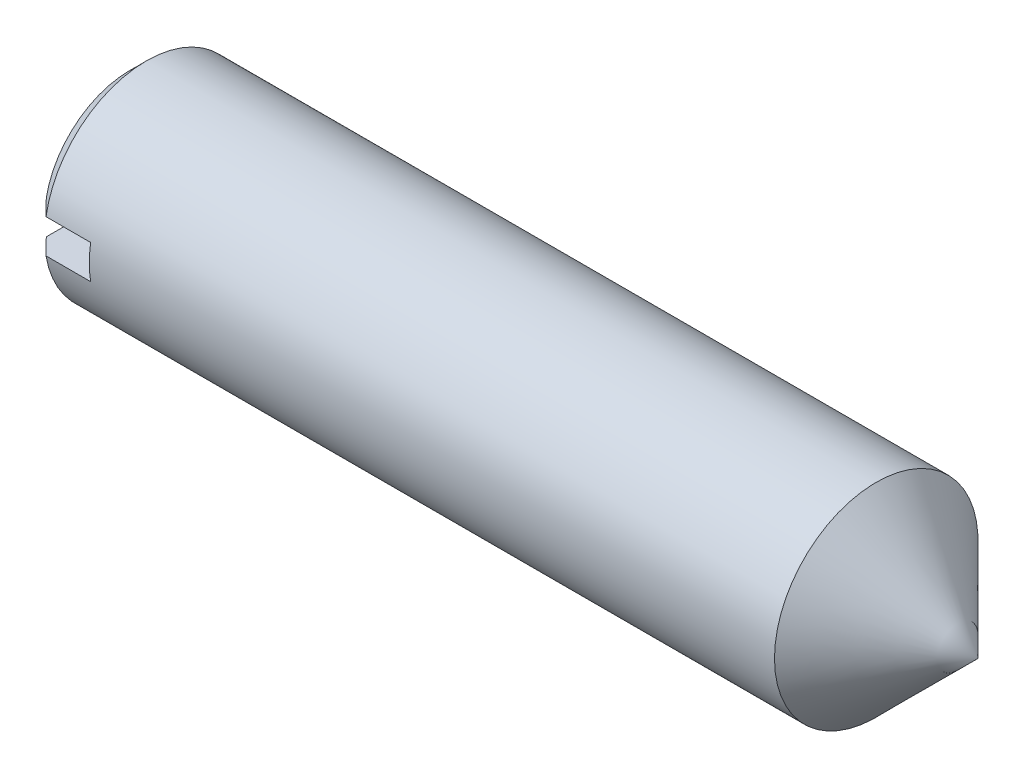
ISO-10303-21;
HEADER;
FILE_DESCRIPTION(('STEP AP214'),'2;1');
FILE_NAME('part.step','',(''),(''),'','','');
FILE_SCHEMA(('AUTOMOTIVE_DESIGN { 1 0 10303 214 1 1 1 1 }'));
ENDSEC;
DATA;
#1=APPLICATION_CONTEXT('core data for automotive mechanical design processes');
#2=APPLICATION_PROTOCOL_DEFINITION('international standard','automotive_design',2000,#1);
#3=PRODUCT_CONTEXT('',#1,'mechanical');
#4=PRODUCT('Part','Part','',(#3));
#5=PRODUCT_RELATED_PRODUCT_CATEGORY('part','',(#4));
#6=PRODUCT_DEFINITION_FORMATION('','',#4);
#7=PRODUCT_DEFINITION_CONTEXT('part definition',#1,'design');
#8=PRODUCT_DEFINITION('design','',#6,#7);
#9=PRODUCT_DEFINITION_SHAPE('','',#8);
#10=(LENGTH_UNIT() NAMED_UNIT(*) SI_UNIT(.MILLI.,.METRE.));
#11=(NAMED_UNIT(*) PLANE_ANGLE_UNIT() SI_UNIT($,.RADIAN.));
#12=(NAMED_UNIT(*) SI_UNIT($,.STERADIAN.) SOLID_ANGLE_UNIT());
#13=UNCERTAINTY_MEASURE_WITH_UNIT(LENGTH_MEASURE(1.E-05),#10,'distance_accuracy_value','');
#14=(GEOMETRIC_REPRESENTATION_CONTEXT(3) GLOBAL_UNCERTAINTY_ASSIGNED_CONTEXT((#13)) GLOBAL_UNIT_ASSIGNED_CONTEXT((#10,
#11,#12)) REPRESENTATION_CONTEXT('',''));
#15=CARTESIAN_POINT('',(0.,0.,0.));
#16=DIRECTION('',(0.,0.,1.));
#17=DIRECTION('',(1.,0.,0.));
#18=AXIS2_PLACEMENT_3D('',#15,#16,#17);
#19=CARTESIAN_POINT('',(0.,0.,0.));
#20=DIRECTION('',(1.,0.,0.));
#21=DIRECTION('',(0.,0.,-1.));
#22=AXIS2_PLACEMENT_3D('',#19,#20,#21);
#23=PLANE('',#22);
#24=DIRECTION('',(0.,0.,-1.));
#25=VECTOR('',#24,1.);
#26=CARTESIAN_POINT('',(0.,-1.,6.));
#27=LINE('',#26,#25);
#28=CARTESIAN_POINT('',(0.,-1.,4.93571636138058));
#29=VERTEX_POINT('',#28);
#30=CARTESIAN_POINT('',(0.,-1.,-4.93571636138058));
#31=VERTEX_POINT('',#30);
#32=EDGE_CURVE('E175',#29,#31,#27,.T.);
#33=ORIENTED_EDGE('',*,*,#32,.T.);
#34=CARTESIAN_POINT('',(0.,0.,0.));
#35=DIRECTION('',(-1.,0.,0.));
#36=DIRECTION('',(0.,0.,1.));
#37=AXIS2_PLACEMENT_3D('',#34,#35,#36);
#38=CIRCLE('',#37,5.036);
#39=EDGE_CURVE('E118',#31,#29,#38,.T.);
#40=ORIENTED_EDGE('',*,*,#39,.T.);
#41=EDGE_LOOP('',(#33,#40));
#42=FACE_BOUND('',#41,.T.);
#43=ADVANCED_FACE('F39',(#42),#23,.F.);
#44=DIRECTION('',(0.,0.,1.));
#45=VECTOR('',#44,1.);
#46=CARTESIAN_POINT('',(0.,1.,6.));
#47=LINE('',#46,#45);
#48=CARTESIAN_POINT('',(0.,1.,-4.93571636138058));
#49=VERTEX_POINT('',#48);
#50=CARTESIAN_POINT('',(0.,1.,4.93571636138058));
#51=VERTEX_POINT('',#50);
#52=EDGE_CURVE('E102',#49,#51,#47,.T.);
#53=ORIENTED_EDGE('',*,*,#52,.T.);
#54=EDGE_CURVE('E114',#51,#49,#38,.T.);
#55=ORIENTED_EDGE('',*,*,#54,.T.);
#56=EDGE_LOOP('',(#53,#55));
#57=FACE_BOUND('',#56,.T.);
#58=ADVANCED_FACE('F168',(#57),#23,.F.);
#59=CARTESIAN_POINT('',(0.964,0.,0.));
#60=DIRECTION('',(1.,0.,0.));
#61=DIRECTION('',(0.,0.,-1.));
#62=AXIS2_PLACEMENT_3D('',#59,#60,#61);
#63=CONICAL_SURFACE('',#62,6.,0.785398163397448);
#64=CARTESIAN_POINT('',(8.18739503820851,-1.,-13.185529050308));
#65=CARTESIAN_POINT('',(7.72173696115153,-1.,-12.71852199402));
#66=CARTESIAN_POINT('',(7.25613875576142,-1.,-12.2514551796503));
#67=CARTESIAN_POINT('',(6.32512700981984,-1.,-11.3171039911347));
#68=CARTESIAN_POINT('',(5.85971347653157,-1.,-10.8498196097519));
#69=CARTESIAN_POINT('',(4.92876157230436,-1.,-9.91455900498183));
#70=CARTESIAN_POINT('',(4.46322344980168,-1.,-9.44658253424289));
#71=CARTESIAN_POINT('',(3.53260322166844,-1.,-8.51020895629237));
#72=CARTESIAN_POINT('',(3.06752110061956,-1.,-8.04181186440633));
#73=CARTESIAN_POINT('',(2.15821966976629,-1.,-7.12462717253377));
#74=CARTESIAN_POINT('',(1.71396996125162,-1.,-6.67586973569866));
#75=CARTESIAN_POINT('',(1.04846409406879,-1.,-6.0018283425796));
#76=CARTESIAN_POINT('',(0.826761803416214,-1.,-5.77698500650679));
#77=CARTESIAN_POINT('',(0.383784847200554,-1.,-5.32688183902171));
#78=CARTESIAN_POINT('',(0.162510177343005,-1.,-5.10162201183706));
#79=CARTESIAN_POINT('',(-0.279302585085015,-1.,-4.65061661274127));
#80=CARTESIAN_POINT('',(-0.499841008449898,-1.,-4.42487136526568));
#81=CARTESIAN_POINT('',(-0.939964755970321,-1.,-3.97243637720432));
#82=CARTESIAN_POINT('',(-1.15955004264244,-1.,-3.74574660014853));
#83=CARTESIAN_POINT('',(-1.5971072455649,-1.,-3.29088888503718));
#84=CARTESIAN_POINT('',(-1.81507945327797,-1.,-3.06272122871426));
#85=CARTESIAN_POINT('',(-2.13978630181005,-1.,-2.71835823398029));
#86=CARTESIAN_POINT('',(-2.24764335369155,-1.,-2.60322226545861));
#87=CARTESIAN_POINT('',(-2.46225552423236,-1.,-2.37192883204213));
#88=CARTESIAN_POINT('',(-2.56901066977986,-1.,-2.25577139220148));
#89=CARTESIAN_POINT('',(-2.70433037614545,-1.,-2.10638744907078));
#90=CARTESIAN_POINT('',(-2.73367252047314,-1.,-2.07386514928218));
#91=CARTESIAN_POINT('',(-2.792206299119,-1.,-2.00868525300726));
#92=CARTESIAN_POINT('',(-2.82139793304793,-1.,-1.97602765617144));
#93=CARTESIAN_POINT('',(-2.90872232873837,-1.,-1.8778206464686));
#94=CARTESIAN_POINT('',(-2.96659914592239,-1.,-1.81204300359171));
#95=CARTESIAN_POINT('',(-3.08184804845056,-1.,-1.67922857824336));
#96=CARTESIAN_POINT('',(-3.13921368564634,-1.,-1.61218618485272));
#97=CARTESIAN_POINT('',(-3.25265645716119,-1.,-1.4770460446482));
#98=CARTESIAN_POINT('',(-3.30873392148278,-1.,-1.40894857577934));
#99=CARTESIAN_POINT('',(-3.41951675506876,-1.,-1.27072673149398));
#100=CARTESIAN_POINT('',(-3.47420734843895,-1.,-1.20059041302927));
#101=CARTESIAN_POINT('',(-3.58078617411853,-1.,-1.05824293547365));
#102=CARTESIAN_POINT('',(-3.63267529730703,-1.,-0.986032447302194));
#103=CARTESIAN_POINT('',(-3.73179995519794,-1.,-0.838985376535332));
#104=CARTESIAN_POINT('',(-3.77906004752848,-1.,-0.764165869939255));
#105=CARTESIAN_POINT('',(-3.84435481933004,-1.,-0.648848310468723));
#106=CARTESIAN_POINT('',(-3.86516971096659,-1.,-0.609933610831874));
#107=CARTESIAN_POINT('',(-3.90433594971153,-1.,-0.530890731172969));
#108=CARTESIAN_POINT('',(-3.9226886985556,-1.,-0.490763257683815));
#109=CARTESIAN_POINT('',(-3.95198906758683,-1.,-0.419353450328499));
#110=CARTESIAN_POINT('',(-3.96364182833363,-1.,-0.388362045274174));
#111=CARTESIAN_POINT('',(-3.98473496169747,-1.,-0.325623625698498));
#112=CARTESIAN_POINT('',(-3.99417524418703,-1.,-0.293876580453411));
#113=CARTESIAN_POINT('',(-4.01039189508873,-1.,-0.229839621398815));
#114=CARTESIAN_POINT('',(-4.0171791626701,-1.,-0.197552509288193));
#115=CARTESIAN_POINT('',(-4.02777094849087,-1.,-0.132494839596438));
#116=CARTESIAN_POINT('',(-4.03157640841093,-1.,-0.0997244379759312));
#117=CARTESIAN_POINT('',(-4.03598217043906,-1.,-0.0336377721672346));
#118=CARTESIAN_POINT('',(-4.03655046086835,-1.,-0.000319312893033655));
#119=CARTESIAN_POINT('',(-4.03436475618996,-1.,0.0662003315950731));
#120=CARTESIAN_POINT('',(-4.03161072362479,-1.,0.099401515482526));
#121=CARTESIAN_POINT('',(-4.01857837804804,-1.,0.19854738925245));
#122=CARTESIAN_POINT('',(-4.0035212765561,-1.,0.263890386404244));
#123=CARTESIAN_POINT('',(-3.96875276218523,-1.,0.375679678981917));
#124=CARTESIAN_POINT('',(-3.95109708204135,-1.,0.422820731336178));
#125=CARTESIAN_POINT('',(-3.91176267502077,-1.,0.515422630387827));
#126=CARTESIAN_POINT('',(-3.89008085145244,-1.,0.560882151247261));
#127=CARTESIAN_POINT('',(-3.8436818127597,-1.,0.650461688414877));
#128=CARTESIAN_POINT('',(-3.81895103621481,-1.,0.694574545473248));
#129=CARTESIAN_POINT('',(-3.76733867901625,-1.,0.78148630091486));
#130=CARTESIAN_POINT('',(-3.74045800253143,-1.,0.824285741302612));
#131=CARTESIAN_POINT('',(-3.6797749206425,-1.,0.916951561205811));
#132=CARTESIAN_POINT('',(-3.64563502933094,-1.,0.966595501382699));
#133=CARTESIAN_POINT('',(-3.57571102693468,-1.,1.06471636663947));
#134=CARTESIAN_POINT('',(-3.5399265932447,-1.,1.11319305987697));
#135=CARTESIAN_POINT('',(-3.43072910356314,-1.,1.25732593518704));
#136=CARTESIAN_POINT('',(-3.35551889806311,-1.,1.35161593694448));
#137=CARTESIAN_POINT('',(-3.2021457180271,-1.,1.53811640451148));
#138=CARTESIAN_POINT('',(-3.12397592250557,-1.,1.63032117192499));
#139=CARTESIAN_POINT('',(-2.96588212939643,-1.,1.81314430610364));
#140=CARTESIAN_POINT('',(-2.88595886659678,-1.,1.90376330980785));
#141=CARTESIAN_POINT('',(-2.72475343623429,-1.,2.08410427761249));
#142=CARTESIAN_POINT('',(-2.64346888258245,-1.,2.17382409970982));
#143=CARTESIAN_POINT('',(-2.48004111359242,-1.,2.35249375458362));
#144=CARTESIAN_POINT('',(-2.39789781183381,-1.,2.44144350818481));
#145=CARTESIAN_POINT('',(-2.2331179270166,-1.,2.61862662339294));
#146=CARTESIAN_POINT('',(-2.15048230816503,-1.,2.70686088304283));
#147=CARTESIAN_POINT('',(-1.98474580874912,-1.,2.88288512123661));
#148=CARTESIAN_POINT('',(-1.90164494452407,-1.,2.97067511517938));
#149=CARTESIAN_POINT('',(-1.6533619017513,-1.,3.23190010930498));
#150=CARTESIAN_POINT('',(-1.4876576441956,-1.,3.40483867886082));
#151=CARTESIAN_POINT('',(-1.15536226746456,-1.,3.74986223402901));
#152=CARTESIAN_POINT('',(-0.98877114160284,-1.,3.92194721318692));
#153=CARTESIAN_POINT('',(-0.488104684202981,-1.,4.43735511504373));
#154=CARTESIAN_POINT('',(-0.153146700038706,-1.,4.7798201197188));
#155=CARTESIAN_POINT('',(0.518172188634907,-1.,5.46378768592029));
#156=CARTESIAN_POINT('',(0.854533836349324,-1.,5.8052895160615));
#157=CARTESIAN_POINT('',(1.52796905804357,-1.,6.48758005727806));
#158=CARTESIAN_POINT('',(1.86504262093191,-1.,6.8283687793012));
#159=CARTESIAN_POINT('',(2.53882709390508,-1.,7.50867429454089));
#160=CARTESIAN_POINT('',(2.87553691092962,-1.,7.84819217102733));
#161=CARTESIAN_POINT('',(3.54926455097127,-1.,8.52692488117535));
#162=CARTESIAN_POINT('',(3.88628237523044,-1.,8.86613971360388));
#163=CARTESIAN_POINT('',(4.89754654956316,-1.,9.88335866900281));
#164=CARTESIAN_POINT('',(5.57211148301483,-1.,10.5610460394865));
#165=CARTESIAN_POINT('',(6.40850112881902,-1.,11.4007367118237));
#166=CARTESIAN_POINT('',(6.57010906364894,-1.,11.5629560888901));
#167=CARTESIAN_POINT('',(6.8933536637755,-1.,11.8873745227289));
#168=CARTESIAN_POINT('',(7.05499032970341,-1.,12.0495735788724));
#169=CARTESIAN_POINT('',(7.37841272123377,-1.,12.3740784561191));
#170=CARTESIAN_POINT('',(7.54019846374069,-1.,12.5363842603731));
#171=CARTESIAN_POINT('',(7.86378498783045,-1.,12.8609725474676));
#172=CARTESIAN_POINT('',(8.02558576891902,-1.,13.0232550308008));
#173=CARTESIAN_POINT('',(8.18739503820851,-1.,13.185529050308));
#174=B_SPLINE_CURVE_WITH_KNOTS('',3,(#64,#65,#66,#67,#68,#69,#70,#71,#72,#73,#74,#75,#76,#77,
#78,#79,#80,#81,#82,#83,#84,#85,#86,#87,#88,#89,#90,#91,#92,#93,#94,#95,#96,#97,#98,#99,#100,
#101,#102,#103,#104,#105,#106,#107,#108,#109,#110,#111,#112,#113,#114,#115,#116,#117,#118,#119,
#120,#121,#122,#123,#124,#125,#126,#127,#128,#129,#130,#131,#132,#133,#134,#135,#136,#137,#138,
#139,#140,#141,#142,#143,#144,#145,#146,#147,#148,#149,#150,#151,#152,#153,#154,#155,#156,#157,
#158,#159,#160,#161,#162,#163,#164,#165,#166,#167,#168,#169,#170,#171,#172,#173),.UNSPECIFIED.,
.F.,.F.,(4,2,2,2,2,2,2,2,2,2,2,2,2,2,2,2,2,2,2,2,2,2,2,2,2,2,2,2,2,2,2,2,2,2,2,2,2,2,2,2,2,2,2,
2,2,2,2,2,2,2,2,2,2,2,4),(0.,1.97848364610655,3.95703862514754,5.93732867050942,
7.91754927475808,9.81192615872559,10.7592155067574,11.7064952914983,12.6532681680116,
13.6000779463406,14.546712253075,15.0199999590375,15.4932760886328,15.6246832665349,
15.7560907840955,16.0189300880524,16.2836250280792,16.5482513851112,16.8150192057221,
17.0817016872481,17.3468825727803,17.4792167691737,17.6114753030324,17.7107371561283,
17.8100030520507,17.9088567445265,18.007679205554,18.1074772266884,18.2072763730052,
18.4072998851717,18.5581246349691,18.7090658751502,18.8607045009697,19.012279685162,
19.1929820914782,19.3737200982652,19.7354462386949,20.0980639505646,20.4605325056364,
20.8237218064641,21.1869480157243,21.5496101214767,21.9122595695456,22.6307874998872,
23.3493208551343,24.7864327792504,26.2244388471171,27.6624226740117,29.0969303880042,
30.5314439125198,33.4000113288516,34.0869540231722,34.7739143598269,35.4614172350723,
36.148902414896),.UNSPECIFIED.);
#175=CARTESIAN_POINT('',(0.964,-1.,-5.91607978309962));
#176=VERTEX_POINT('',#175);
#177=EDGE_CURVE('E132',#176,#31,#174,.T.);
#178=ORIENTED_EDGE('',*,*,#177,.F.);
#179=CARTESIAN_POINT('',(0.964,0.,0.));
#180=DIRECTION('',(-1.,0.,0.));
#181=DIRECTION('',(0.,0.,1.));
#182=AXIS2_PLACEMENT_3D('',#179,#180,#181);
#183=CIRCLE('',#182,6.);
#184=CARTESIAN_POINT('',(0.964,-1.,5.91607978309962));
#185=VERTEX_POINT('',#184);
#186=EDGE_CURVE('E129',#176,#185,#183,.T.);
#187=ORIENTED_EDGE('',*,*,#186,.T.);
#188=EDGE_CURVE('E95',#29,#185,#174,.T.);
#189=ORIENTED_EDGE('',*,*,#188,.F.);
#190=ORIENTED_EDGE('',*,*,#39,.F.);
#191=EDGE_LOOP('',(#178,#187,#189,#190));
#192=FACE_BOUND('',#191,.T.);
#193=ADVANCED_FACE('F149',(#192),#63,.T.);
#194=CARTESIAN_POINT('',(8.18739503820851,1.,13.185529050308));
#195=CARTESIAN_POINT('',(7.72173696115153,1.,12.71852199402));
#196=CARTESIAN_POINT('',(7.25613875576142,1.,12.2514551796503));
#197=CARTESIAN_POINT('',(6.32512700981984,1.,11.3171039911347));
#198=CARTESIAN_POINT('',(5.85971347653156,1.,10.8498196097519));
#199=CARTESIAN_POINT('',(4.92876157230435,1.,9.91455900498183));
#200=CARTESIAN_POINT('',(4.46322344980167,1.,9.44658253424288));
#201=CARTESIAN_POINT('',(3.53260322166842,1.,8.51020895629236));
#202=CARTESIAN_POINT('',(3.06752110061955,1.,8.04181186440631));
#203=CARTESIAN_POINT('',(2.15821966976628,1.,7.12462717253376));
#204=CARTESIAN_POINT('',(1.71396996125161,1.,6.67586973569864));
#205=CARTESIAN_POINT('',(1.04846409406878,1.,6.00182834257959));
#206=CARTESIAN_POINT('',(0.826761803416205,1.,5.77698500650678));
#207=CARTESIAN_POINT('',(0.383784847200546,1.,5.3268818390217));
#208=CARTESIAN_POINT('',(0.162510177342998,1.,5.10162201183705));
#209=CARTESIAN_POINT('',(-0.279302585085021,1.,4.65061661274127));
#210=CARTESIAN_POINT('',(-0.499841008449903,1.,4.42487136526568));
#211=CARTESIAN_POINT('',(-0.939964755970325,1.,3.97243637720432));
#212=CARTESIAN_POINT('',(-1.15955004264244,1.,3.74574660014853));
#213=CARTESIAN_POINT('',(-1.5971072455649,1.,3.29088888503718));
#214=CARTESIAN_POINT('',(-1.81507945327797,1.,3.06272122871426));
#215=CARTESIAN_POINT('',(-2.13978630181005,1.,2.71835823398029));
#216=CARTESIAN_POINT('',(-2.24764335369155,1.,2.60322226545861));
#217=CARTESIAN_POINT('',(-2.46225552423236,1.,2.37192883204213));
#218=CARTESIAN_POINT('',(-2.56901066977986,1.,2.25577139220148));
#219=CARTESIAN_POINT('',(-2.70433037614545,1.,2.10638744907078));
#220=CARTESIAN_POINT('',(-2.73367252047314,1.,2.07386514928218));
#221=CARTESIAN_POINT('',(-2.79220629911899,1.,2.00868525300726));
#222=CARTESIAN_POINT('',(-2.82139793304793,1.,1.97602765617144));
#223=CARTESIAN_POINT('',(-2.90872232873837,1.,1.8778206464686));
#224=CARTESIAN_POINT('',(-2.96659914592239,1.,1.81204300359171));
#225=CARTESIAN_POINT('',(-3.08184804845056,1.,1.67922857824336));
#226=CARTESIAN_POINT('',(-3.13921368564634,1.,1.61218618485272));
#227=CARTESIAN_POINT('',(-3.25265645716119,1.,1.4770460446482));
#228=CARTESIAN_POINT('',(-3.30873392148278,1.,1.40894857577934));
#229=CARTESIAN_POINT('',(-3.41951675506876,1.,1.27072673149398));
#230=CARTESIAN_POINT('',(-3.47420734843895,1.,1.20059041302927));
#231=CARTESIAN_POINT('',(-3.58078617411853,1.,1.05824293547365));
#232=CARTESIAN_POINT('',(-3.63267529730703,1.,0.986032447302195));
#233=CARTESIAN_POINT('',(-3.73179995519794,1.,0.838985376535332));
#234=CARTESIAN_POINT('',(-3.77906004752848,1.,0.764165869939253));
#235=CARTESIAN_POINT('',(-3.84435481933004,1.,0.648848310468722));
#236=CARTESIAN_POINT('',(-3.86516971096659,1.,0.609933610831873));
#237=CARTESIAN_POINT('',(-3.90433594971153,1.,0.530890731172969));
#238=CARTESIAN_POINT('',(-3.9226886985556,1.,0.490763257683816));
#239=CARTESIAN_POINT('',(-3.95198906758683,1.,0.419353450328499));
#240=CARTESIAN_POINT('',(-3.96364182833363,1.,0.388362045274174));
#241=CARTESIAN_POINT('',(-3.98473496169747,1.,0.325623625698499));
#242=CARTESIAN_POINT('',(-3.99417524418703,1.,0.293876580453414));
#243=CARTESIAN_POINT('',(-4.01039189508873,1.,0.229839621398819));
#244=CARTESIAN_POINT('',(-4.0171791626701,1.,0.197552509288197));
#245=CARTESIAN_POINT('',(-4.02777094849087,1.,0.132494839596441));
#246=CARTESIAN_POINT('',(-4.03157640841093,1.,0.0997244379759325));
#247=CARTESIAN_POINT('',(-4.03598217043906,1.,0.0336377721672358));
#248=CARTESIAN_POINT('',(-4.03655046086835,1.,0.000319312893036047));
#249=CARTESIAN_POINT('',(-4.03436475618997,1.,-0.0662003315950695));
#250=CARTESIAN_POINT('',(-4.03161072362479,1.,-0.0994015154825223));
#251=CARTESIAN_POINT('',(-4.01857837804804,1.,-0.198547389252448));
#252=CARTESIAN_POINT('',(-4.0035212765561,1.,-0.263890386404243));
#253=CARTESIAN_POINT('',(-3.96875276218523,1.,-0.375679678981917));
#254=CARTESIAN_POINT('',(-3.95109708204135,1.,-0.422820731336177));
#255=CARTESIAN_POINT('',(-3.91176267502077,1.,-0.515422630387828));
#256=CARTESIAN_POINT('',(-3.89008085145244,1.,-0.560882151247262));
#257=CARTESIAN_POINT('',(-3.8436818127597,1.,-0.650461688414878));
#258=CARTESIAN_POINT('',(-3.81895103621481,1.,-0.694574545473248));
#259=CARTESIAN_POINT('',(-3.76733867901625,1.,-0.781486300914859));
#260=CARTESIAN_POINT('',(-3.74045800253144,1.,-0.824285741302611));
#261=CARTESIAN_POINT('',(-3.6797749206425,1.,-0.916951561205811));
#262=CARTESIAN_POINT('',(-3.64563502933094,1.,-0.966595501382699));
#263=CARTESIAN_POINT('',(-3.57571102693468,1.,-1.06471636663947));
#264=CARTESIAN_POINT('',(-3.5399265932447,1.,-1.11319305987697));
#265=CARTESIAN_POINT('',(-3.43072910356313,1.,-1.25732593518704));
#266=CARTESIAN_POINT('',(-3.35551889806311,1.,-1.35161593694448));
#267=CARTESIAN_POINT('',(-3.20214571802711,1.,-1.53811640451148));
#268=CARTESIAN_POINT('',(-3.12397592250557,1.,-1.63032117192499));
#269=CARTESIAN_POINT('',(-2.96588212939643,1.,-1.81314430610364));
#270=CARTESIAN_POINT('',(-2.88595886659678,1.,-1.90376330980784));
#271=CARTESIAN_POINT('',(-2.7247534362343,1.,-2.08410427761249));
#272=CARTESIAN_POINT('',(-2.64346888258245,1.,-2.17382409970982));
#273=CARTESIAN_POINT('',(-2.48004111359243,1.,-2.35249375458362));
#274=CARTESIAN_POINT('',(-2.39789781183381,1.,-2.44144350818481));
#275=CARTESIAN_POINT('',(-2.2331179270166,1.,-2.61862662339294));
#276=CARTESIAN_POINT('',(-2.15048230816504,1.,-2.70686088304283));
#277=CARTESIAN_POINT('',(-1.98474580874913,1.,-2.88288512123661));
#278=CARTESIAN_POINT('',(-1.90164494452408,1.,-2.97067511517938));
#279=CARTESIAN_POINT('',(-1.6533619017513,1.,-3.23190010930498));
#280=CARTESIAN_POINT('',(-1.4876576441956,1.,-3.40483867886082));
#281=CARTESIAN_POINT('',(-1.15536226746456,1.,-3.74986223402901));
#282=CARTESIAN_POINT('',(-0.98877114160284,1.,-3.92194721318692));
#283=CARTESIAN_POINT('',(-0.488104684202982,1.,-4.43735511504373));
#284=CARTESIAN_POINT('',(-0.153146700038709,1.,-4.7798201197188));
#285=CARTESIAN_POINT('',(0.518172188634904,1.,-5.46378768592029));
#286=CARTESIAN_POINT('',(0.854533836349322,1.,-5.8052895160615));
#287=CARTESIAN_POINT('',(1.52796905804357,1.,-6.48758005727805));
#288=CARTESIAN_POINT('',(1.86504262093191,1.,-6.82836877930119));
#289=CARTESIAN_POINT('',(2.53882709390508,1.,-7.50867429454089));
#290=CARTESIAN_POINT('',(2.87553691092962,1.,-7.84819217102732));
#291=CARTESIAN_POINT('',(3.54926455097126,1.,-8.52692488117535));
#292=CARTESIAN_POINT('',(3.88628237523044,1.,-8.86613971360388));
#293=CARTESIAN_POINT('',(4.89754654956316,1.,-9.8833586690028));
#294=CARTESIAN_POINT('',(5.57211148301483,1.,-10.5610460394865));
#295=CARTESIAN_POINT('',(6.40850112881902,1.,-11.4007367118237));
#296=CARTESIAN_POINT('',(6.57010906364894,1.,-11.5629560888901));
#297=CARTESIAN_POINT('',(6.8933536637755,1.,-11.8873745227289));
#298=CARTESIAN_POINT('',(7.05499032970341,1.,-12.0495735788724));
#299=CARTESIAN_POINT('',(7.37841272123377,1.,-12.3740784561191));
#300=CARTESIAN_POINT('',(7.54019846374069,1.,-12.5363842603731));
#301=CARTESIAN_POINT('',(7.86378498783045,1.,-12.8609725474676));
#302=CARTESIAN_POINT('',(8.02558576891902,1.,-13.0232550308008));
#303=CARTESIAN_POINT('',(8.18739503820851,1.,-13.185529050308));
#304=B_SPLINE_CURVE_WITH_KNOTS('',3,(#194,#195,#196,#197,#198,#199,#200,#201,#202,#203,#204,
#205,#206,#207,#208,#209,#210,#211,#212,#213,#214,#215,#216,#217,#218,#219,#220,#221,#222,#223,
#224,#225,#226,#227,#228,#229,#230,#231,#232,#233,#234,#235,#236,#237,#238,#239,#240,#241,#242,
#243,#244,#245,#246,#247,#248,#249,#250,#251,#252,#253,#254,#255,#256,#257,#258,#259,#260,#261,
#262,#263,#264,#265,#266,#267,#268,#269,#270,#271,#272,#273,#274,#275,#276,#277,#278,#279,#280,
#281,#282,#283,#284,#285,#286,#287,#288,#289,#290,#291,#292,#293,#294,#295,#296,#297,#298,#299,
#300,#301,#302,#303),.UNSPECIFIED.,.F.,.F.,(4,2,2,2,2,2,2,2,2,2,2,2,2,2,2,2,2,2,2,2,2,2,2,2,2,2,
2,2,2,2,2,2,2,2,2,2,2,2,2,2,2,2,2,2,2,2,2,2,2,2,2,2,2,2,4),(0.,1.97848364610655,
3.95703862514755,5.93732867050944,7.9175492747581,9.8119261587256,10.7592155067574,
11.7064952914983,12.6532681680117,13.6000779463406,14.546712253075,15.0199999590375,
15.4932760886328,15.6246832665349,15.7560907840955,16.0189300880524,16.2836250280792,
16.5482513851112,16.8150192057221,17.0817016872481,17.3468825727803,17.4792167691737,
17.6114753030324,17.7107371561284,17.8100030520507,17.9088567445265,18.007679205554,
18.1074772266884,18.2072763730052,18.4072998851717,18.5581246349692,18.7090658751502,
18.8607045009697,19.012279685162,19.1929820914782,19.3737200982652,19.7354462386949,
20.0980639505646,20.4605325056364,20.8237218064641,21.1869480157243,21.5496101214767,
21.9122595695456,22.6307874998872,23.3493208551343,24.7864327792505,26.2244388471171,
27.6624226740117,29.0969303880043,30.5314439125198,33.4000113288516,34.0869540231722,
34.7739143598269,35.4614172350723,36.148902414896),.UNSPECIFIED.);
#305=CARTESIAN_POINT('',(0.964,1.,5.91607978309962));
#306=VERTEX_POINT('',#305);
#307=EDGE_CURVE('E140',#306,#51,#304,.T.);
#308=ORIENTED_EDGE('',*,*,#307,.F.);
#309=CARTESIAN_POINT('',(0.964,1.,-5.91607978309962));
#310=VERTEX_POINT('',#309);
#311=EDGE_CURVE('E121',#306,#310,#183,.T.);
#312=ORIENTED_EDGE('',*,*,#311,.T.);
#313=EDGE_CURVE('E138',#49,#310,#304,.T.);
#314=ORIENTED_EDGE('',*,*,#313,.F.);
#315=ORIENTED_EDGE('',*,*,#54,.F.);
#316=EDGE_LOOP('',(#308,#312,#314,#315));
#317=FACE_BOUND('',#316,.T.);
#318=ADVANCED_FACE('F158',(#317),#63,.T.);
#319=CARTESIAN_POINT('',(0.,0.,0.));
#320=DIRECTION('',(-1.,0.,0.));
#321=DIRECTION('',(0.,0.,1.));
#322=AXIS2_PLACEMENT_3D('',#319,#320,#321);
#323=CYLINDRICAL_SURFACE('',#322,6.);
#324=CARTESIAN_POINT('',(43.9999999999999,0.,0.));
#325=DIRECTION('',(-1.,0.,0.));
#326=DIRECTION('',(0.,0.,1.));
#327=AXIS2_PLACEMENT_3D('',#324,#325,#326);
#328=CIRCLE('',#327,6.);
#329=CARTESIAN_POINT('',(43.9999999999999,0.,6.));
#330=VERTEX_POINT('',#329);
#331=EDGE_CURVE('E130',#330,#330,#328,.T.);
#332=ORIENTED_EDGE('',*,*,#331,.T.);
#333=EDGE_LOOP('',(#332));
#334=FACE_BOUND('',#333,.T.);
#335=DIRECTION('',(-1.,0.,0.));
#336=VECTOR('',#335,1.);
#337=CARTESIAN_POINT('',(0.,-1.,5.91607978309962));
#338=LINE('',#337,#336);
#339=CARTESIAN_POINT('',(3.6,-1.,5.91607978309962));
#340=VERTEX_POINT('',#339);
#341=EDGE_CURVE('E11',#185,#340,#338,.F.);
#342=ORIENTED_EDGE('',*,*,#341,.F.);
#343=ORIENTED_EDGE('',*,*,#186,.F.);
#344=DIRECTION('',(-1.,0.,0.));
#345=VECTOR('',#344,1.);
#346=CARTESIAN_POINT('',(0.,-1.,-5.91607978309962));
#347=LINE('',#346,#345);
#348=CARTESIAN_POINT('',(3.6,-1.,-5.91607978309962));
#349=VERTEX_POINT('',#348);
#350=EDGE_CURVE('E57',#349,#176,#347,.T.);
#351=ORIENTED_EDGE('',*,*,#350,.F.);
#352=CARTESIAN_POINT('',(3.6,0.,0.));
#353=DIRECTION('',(1.,0.,0.));
#354=DIRECTION('',(0.,0.,-1.));
#355=AXIS2_PLACEMENT_3D('',#352,#353,#354);
#356=CIRCLE('',#355,6.);
#357=CARTESIAN_POINT('',(3.6,1.,-5.91607978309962));
#358=VERTEX_POINT('',#357);
#359=EDGE_CURVE('E101',#349,#358,#356,.T.);
#360=ORIENTED_EDGE('',*,*,#359,.T.);
#361=DIRECTION('',(-1.,0.,0.));
#362=VECTOR('',#361,1.);
#363=CARTESIAN_POINT('',(0.,1.,-5.91607978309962));
#364=LINE('',#363,#362);
#365=EDGE_CURVE('E111',#310,#358,#364,.F.);
#366=ORIENTED_EDGE('',*,*,#365,.F.);
#367=ORIENTED_EDGE('',*,*,#311,.F.);
#368=DIRECTION('',(-1.,0.,0.));
#369=VECTOR('',#368,1.);
#370=CARTESIAN_POINT('',(0.,1.,5.91607978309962));
#371=LINE('',#370,#369);
#372=CARTESIAN_POINT('',(3.6,1.,5.91607978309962));
#373=VERTEX_POINT('',#372);
#374=EDGE_CURVE('E46',#373,#306,#371,.T.);
#375=ORIENTED_EDGE('',*,*,#374,.F.);
#376=EDGE_CURVE('E103',#373,#340,#356,.T.);
#377=ORIENTED_EDGE('',*,*,#376,.T.);
#378=EDGE_LOOP('',(#342,#343,#351,#360,#366,#367,#375,#377));
#379=FACE_BOUND('',#378,.T.);
#380=ADVANCED_FACE('F108',(#334,#379),#323,.T.);
#381=CARTESIAN_POINT('',(50.,0.,0.));
#382=DIRECTION('',(-1.,0.,0.));
#383=DIRECTION('',(0.,0.,1.));
#384=AXIS2_PLACEMENT_3D('',#381,#382,#383);
#385=CONICAL_SURFACE('',#384,0.,0.785398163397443);
#386=ORIENTED_EDGE('',*,*,#331,.F.);
#387=EDGE_LOOP('',(#386));
#388=FACE_BOUND('',#387,.T.);
#389=CARTESIAN_POINT('',(50.,0.,0.));
#390=VERTEX_POINT('',#389);
#391=VERTEX_LOOP('',#390);
#392=FACE_BOUND('',#391,.T.);
#393=ADVANCED_FACE('F153',(#388,#392),#385,.T.);
#394=CARTESIAN_POINT('',(3.6,-1.,6.));
#395=DIRECTION('',(0.,1.,0.));
#396=DIRECTION('',(0.,0.,1.));
#397=AXIS2_PLACEMENT_3D('',#394,#395,#396);
#398=PLANE('',#397);
#399=ORIENTED_EDGE('',*,*,#177,.T.);
#400=ORIENTED_EDGE('',*,*,#32,.F.);
#401=ORIENTED_EDGE('',*,*,#188,.T.);
#402=ORIENTED_EDGE('',*,*,#341,.T.);
#403=DIRECTION('',(0.,0.,-1.));
#404=VECTOR('',#403,1.);
#405=CARTESIAN_POINT('',(3.6,-1.,6.));
#406=LINE('',#405,#404);
#407=EDGE_CURVE('E94',#340,#349,#406,.T.);
#408=ORIENTED_EDGE('',*,*,#407,.T.);
#409=ORIENTED_EDGE('',*,*,#350,.T.);
#410=EDGE_LOOP('',(#399,#400,#401,#402,#408,#409));
#411=FACE_BOUND('',#410,.T.);
#412=ADVANCED_FACE('F86',(#411),#398,.T.);
#413=CARTESIAN_POINT('',(3.6,1.,6.));
#414=DIRECTION('',(0.,-1.,0.));
#415=DIRECTION('',(0.,0.,-1.));
#416=AXIS2_PLACEMENT_3D('',#413,#414,#415);
#417=PLANE('',#416);
#418=ORIENTED_EDGE('',*,*,#307,.T.);
#419=ORIENTED_EDGE('',*,*,#52,.F.);
#420=ORIENTED_EDGE('',*,*,#313,.T.);
#421=ORIENTED_EDGE('',*,*,#365,.T.);
#422=DIRECTION('',(0.,0.,1.));
#423=VECTOR('',#422,1.);
#424=CARTESIAN_POINT('',(3.6,1.,6.));
#425=LINE('',#424,#423);
#426=EDGE_CURVE('E104',#358,#373,#425,.T.);
#427=ORIENTED_EDGE('',*,*,#426,.T.);
#428=ORIENTED_EDGE('',*,*,#374,.T.);
#429=EDGE_LOOP('',(#418,#419,#420,#421,#427,#428));
#430=FACE_BOUND('',#429,.T.);
#431=ADVANCED_FACE('F155',(#430),#417,.T.);
#432=CARTESIAN_POINT('',(3.6,-1.,6.));
#433=DIRECTION('',(1.,0.,0.));
#434=DIRECTION('',(0.,0.,-1.));
#435=AXIS2_PLACEMENT_3D('',#432,#433,#434);
#436=PLANE('',#435);
#437=ORIENTED_EDGE('',*,*,#426,.F.);
#438=ORIENTED_EDGE('',*,*,#359,.F.);
#439=ORIENTED_EDGE('',*,*,#407,.F.);
#440=ORIENTED_EDGE('',*,*,#376,.F.);
#441=EDGE_LOOP('',(#437,#438,#439,#440));
#442=FACE_BOUND('',#441,.T.);
#443=ADVANCED_FACE('F99',(#442),#436,.F.);
#444=CLOSED_SHELL('',(#43,#58,#193,#318,#380,#393,#412,#431,#443));
#445=MANIFOLD_SOLID_BREP('B2',#444);
#446=ADVANCED_BREP_SHAPE_REPRESENTATION('',(#18,#445),#14);
#447=SHAPE_DEFINITION_REPRESENTATION(#9,#446);
ENDSEC;
END-ISO-10303-21;
